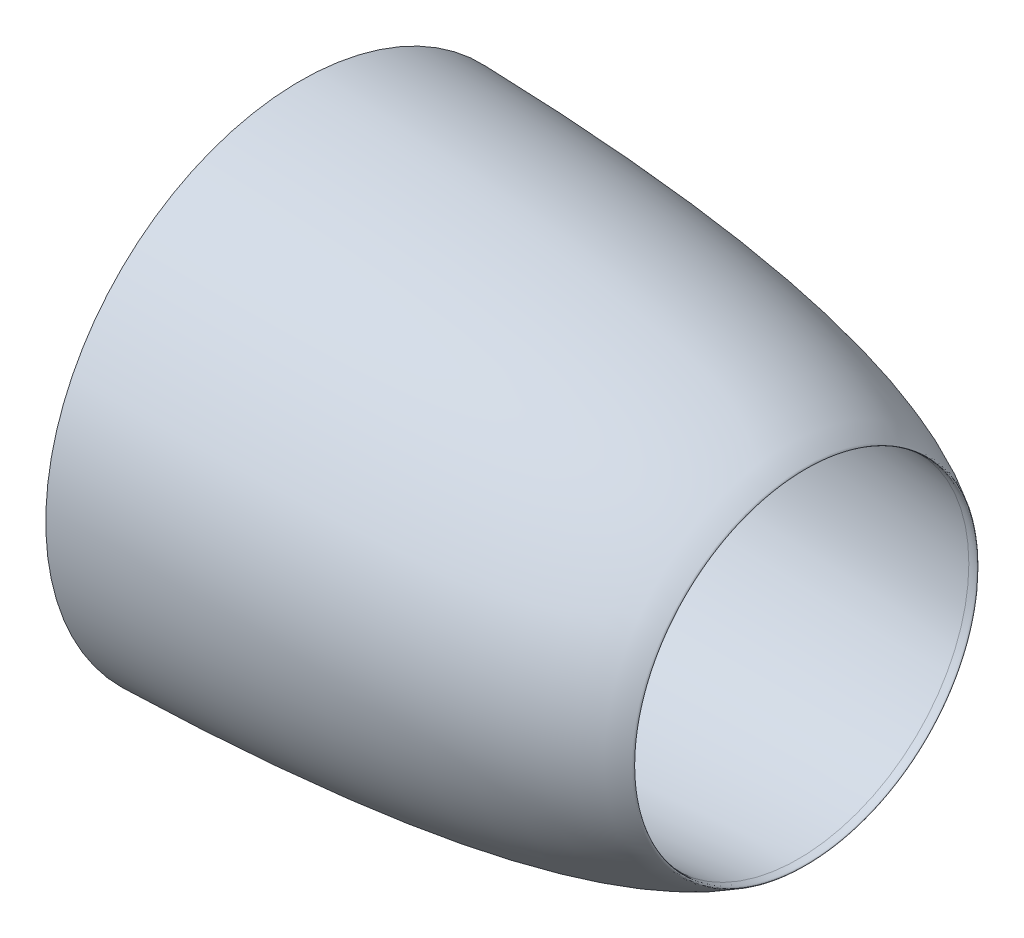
from build123d import *


with BuildPart() as part:
    # Esquisse1 → R_volution1 (revolve)
    with BuildSketch(Plane.XY, mode=Mode.PRIVATE) as r_volution1_sk:
        with BuildLine():
            add(Edge.make_bspline(
                [(-16.269542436, 49.227373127), (57.700040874, 47.516080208), (82.436917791, 32.805397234), (80, 33.000906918)],
                knots=[0, 0, 0, 0.940488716, 1, 1, 1], degree=2))
            Line((80, 33.000906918), (0, 40))
            ThreePointArc((0, 40), (-9.139031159, 42.842993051), (-16.269542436, 49.227373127))
        make_face()
    revolve(r_volution1_sk.sketch.rotate(Axis((113.006693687, 0, 0), (-1, 0, 0)), 90), axis=Axis((113.006693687, 0, 0), (-1, 0, 0)))


solid = part.part
